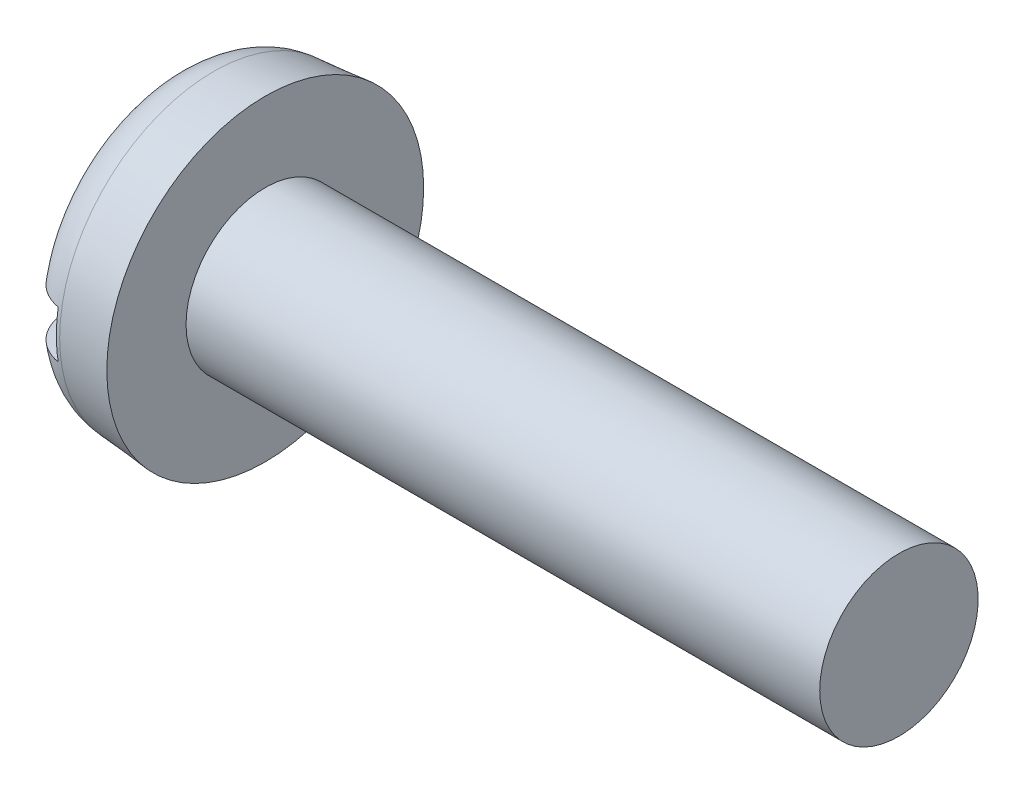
ISO-10303-21;
HEADER;
FILE_DESCRIPTION(('STEP AP214'),'2;1');
FILE_NAME('part.step','',(''),(''),'','','');
FILE_SCHEMA(('AUTOMOTIVE_DESIGN { 1 0 10303 214 1 1 1 1 }'));
ENDSEC;
DATA;
#1=APPLICATION_CONTEXT('core data for automotive mechanical design processes');
#2=APPLICATION_PROTOCOL_DEFINITION('international standard','automotive_design',2000,#1);
#3=PRODUCT_CONTEXT('',#1,'mechanical');
#4=PRODUCT('Part','Part','',(#3));
#5=PRODUCT_RELATED_PRODUCT_CATEGORY('part','',(#4));
#6=PRODUCT_DEFINITION_FORMATION('','',#4);
#7=PRODUCT_DEFINITION_CONTEXT('part definition',#1,'design');
#8=PRODUCT_DEFINITION('design','',#6,#7);
#9=PRODUCT_DEFINITION_SHAPE('','',#8);
#10=(LENGTH_UNIT() NAMED_UNIT(*) SI_UNIT(.MILLI.,.METRE.));
#11=(NAMED_UNIT(*) PLANE_ANGLE_UNIT() SI_UNIT($,.RADIAN.));
#12=(NAMED_UNIT(*) SI_UNIT($,.STERADIAN.) SOLID_ANGLE_UNIT());
#13=UNCERTAINTY_MEASURE_WITH_UNIT(LENGTH_MEASURE(1.E-05),#10,'distance_accuracy_value','');
#14=(GEOMETRIC_REPRESENTATION_CONTEXT(3) GLOBAL_UNCERTAINTY_ASSIGNED_CONTEXT((#13)) GLOBAL_UNIT_ASSIGNED_CONTEXT((#10,
#11,#12)) REPRESENTATION_CONTEXT('',''));
#15=CARTESIAN_POINT('',(0.,0.,0.));
#16=DIRECTION('',(0.,0.,1.));
#17=DIRECTION('',(1.,0.,0.));
#18=AXIS2_PLACEMENT_3D('',#15,#16,#17);
#19=CARTESIAN_POINT('',(0.,0.,0.));
#20=DIRECTION('',(-1.,0.,0.));
#21=DIRECTION('',(0.,0.,1.));
#22=AXIS2_PLACEMENT_3D('',#19,#20,#21);
#23=PLANE('',#22);
#24=DIRECTION('',(0.,0.,-1.));
#25=VECTOR('',#24,1.);
#26=CARTESIAN_POINT('',(0.,0.599999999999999,4.));
#27=LINE('',#26,#25);
#28=CARTESIAN_POINT('',(0.,0.599999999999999,2.62267277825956));
#29=VERTEX_POINT('',#28);
#30=CARTESIAN_POINT('',(0.,0.599999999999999,-2.62267277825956));
#31=VERTEX_POINT('',#30);
#32=EDGE_CURVE('E89',#29,#31,#27,.T.);
#33=ORIENTED_EDGE('',*,*,#32,.F.);
#34=CARTESIAN_POINT('',(0.,0.,0.));
#35=DIRECTION('',(-1.,0.,0.));
#36=DIRECTION('',(0.,0.,1.));
#37=AXIS2_PLACEMENT_3D('',#34,#35,#36);
#38=CIRCLE('',#37,2.69042979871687);
#39=EDGE_CURVE('E95',#29,#31,#38,.T.);
#40=ORIENTED_EDGE('',*,*,#39,.T.);
#41=EDGE_LOOP('',(#33,#40));
#42=FACE_BOUND('',#41,.T.);
#43=ADVANCED_FACE('F36',(#42),#23,.T.);
#44=CARTESIAN_POINT('',(-25.4,0.,0.));
#45=DIRECTION('',(-1.,0.,0.));
#46=DIRECTION('',(0.,0.,1.));
#47=AXIS2_PLACEMENT_3D('',#44,#45,#46);
#48=CYLINDRICAL_SURFACE('',#47,2.);
#49=CARTESIAN_POINT('',(18.4,0.,0.));
#50=DIRECTION('',(-1.,0.,0.));
#51=DIRECTION('',(0.,0.,1.));
#52=AXIS2_PLACEMENT_3D('',#49,#50,#51);
#53=CIRCLE('',#52,2.);
#54=CARTESIAN_POINT('',(18.4,0.,2.));
#55=VERTEX_POINT('',#54);
#56=EDGE_CURVE('E96',#55,#55,#53,.T.);
#57=ORIENTED_EDGE('',*,*,#56,.T.);
#58=EDGE_LOOP('',(#57));
#59=FACE_BOUND('',#58,.T.);
#60=CARTESIAN_POINT('',(2.4,0.,0.));
#61=DIRECTION('',(-1.,0.,0.));
#62=DIRECTION('',(0.,0.,1.));
#63=AXIS2_PLACEMENT_3D('',#60,#61,#62);
#64=CIRCLE('',#63,2.);
#65=CARTESIAN_POINT('',(2.4,0.,2.));
#66=VERTEX_POINT('',#65);
#67=EDGE_CURVE('E153',#66,#66,#64,.T.);
#68=ORIENTED_EDGE('',*,*,#67,.F.);
#69=EDGE_LOOP('',(#68));
#70=FACE_BOUND('',#69,.T.);
#71=ADVANCED_FACE('F141',(#59,#70),#48,.T.);
#72=CARTESIAN_POINT('',(18.4,2.,0.));
#73=DIRECTION('',(1.,0.,0.));
#74=DIRECTION('',(0.,0.,-1.));
#75=AXIS2_PLACEMENT_3D('',#72,#73,#74);
#76=PLANE('',#75);
#77=ORIENTED_EDGE('',*,*,#56,.F.);
#78=EDGE_LOOP('',(#77));
#79=FACE_BOUND('',#78,.T.);
#80=ADVANCED_FACE('F139',(#79),#76,.T.);
#81=DIRECTION('',(0.,0.,1.));
#82=VECTOR('',#81,1.);
#83=CARTESIAN_POINT('',(0.,-0.599999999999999,-4.));
#84=LINE('',#83,#82);
#85=CARTESIAN_POINT('',(0.,-0.6,-2.62267277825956));
#86=VERTEX_POINT('',#85);
#87=CARTESIAN_POINT('',(0.,-0.6,2.62267277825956));
#88=VERTEX_POINT('',#87);
#89=EDGE_CURVE('E80',#86,#88,#84,.T.);
#90=ORIENTED_EDGE('',*,*,#89,.F.);
#91=EDGE_CURVE('E87',#86,#88,#38,.T.);
#92=ORIENTED_EDGE('',*,*,#91,.T.);
#93=EDGE_LOOP('',(#90,#92));
#94=FACE_BOUND('',#93,.T.);
#95=ADVANCED_FACE('F86',(#94),#23,.T.);
#96=CARTESIAN_POINT('',(0.,0.,0.));
#97=DIRECTION('',(1.,0.,0.));
#98=DIRECTION('',(0.,0.,-1.));
#99=AXIS2_PLACEMENT_3D('',#96,#97,#98);
#100=CONICAL_SURFACE('',#99,3.79002720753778,0.0872664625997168);
#101=CARTESIAN_POINT('',(1.09541310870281,0.,0.));
#102=DIRECTION('',(-1.,0.,0.));
#103=DIRECTION('',(0.,0.,1.));
#104=AXIS2_PLACEMENT_3D('',#101,#102,#103);
#105=CIRCLE('',#104,3.88586343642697);
#106=CARTESIAN_POINT('',(1.09541310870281,0.,3.88586343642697));
#107=VERTEX_POINT('',#106);
#108=EDGE_CURVE('E99',#107,#107,#105,.F.);
#109=ORIENTED_EDGE('',*,*,#108,.T.);
#110=EDGE_LOOP('',(#109));
#111=FACE_BOUND('',#110,.T.);
#112=CARTESIAN_POINT('',(2.4,0.,0.));
#113=DIRECTION('',(-1.,0.,0.));
#114=DIRECTION('',(0.,0.,1.));
#115=AXIS2_PLACEMENT_3D('',#112,#113,#114);
#116=CIRCLE('',#115,4.);
#117=CARTESIAN_POINT('',(2.4,0.,4.));
#118=VERTEX_POINT('',#117);
#119=EDGE_CURVE('E101',#118,#118,#116,.T.);
#120=ORIENTED_EDGE('',*,*,#119,.T.);
#121=EDGE_LOOP('',(#120));
#122=FACE_BOUND('',#121,.T.);
#123=ADVANCED_FACE('F132',(#111,#122),#100,.T.);
#124=CARTESIAN_POINT('',(2.4,2.,0.));
#125=DIRECTION('',(-1.,0.,0.));
#126=DIRECTION('',(0.,0.,1.));
#127=AXIS2_PLACEMENT_3D('',#124,#125,#126);
#128=PLANE('',#127);
#129=ORIENTED_EDGE('',*,*,#119,.F.);
#130=EDGE_LOOP('',(#129));
#131=FACE_BOUND('',#130,.T.);
#132=ORIENTED_EDGE('',*,*,#67,.T.);
#133=EDGE_LOOP('',(#132));
#134=FACE_BOUND('',#133,.T.);
#135=ADVANCED_FACE('F128',(#131,#134),#128,.F.);
#136=CARTESIAN_POINT('',(1.2,0.,0.));
#137=DIRECTION('',(-1.,0.,0.));
#138=DIRECTION('',(0.,0.,1.));
#139=AXIS2_PLACEMENT_3D('',#136,#137,#138);
#140=TOROIDAL_SURFACE('',#139,2.69042979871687,1.2);
#141=CARTESIAN_POINT('',(0.3865043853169,0.599999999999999,-3.52185650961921));
#142=CARTESIAN_POINT('',(0.435468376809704,0.599999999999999,-3.56765543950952));
#143=CARTESIAN_POINT('',(0.48830443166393,0.599999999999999,-3.60938194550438));
#144=CARTESIAN_POINT('',(0.600265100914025,0.599999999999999,-3.68342203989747));
#145=CARTESIAN_POINT('',(0.659396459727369,0.599999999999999,-3.71572539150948));
#146=CARTESIAN_POINT('',(0.782252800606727,0.599999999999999,-3.76991557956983));
#147=CARTESIAN_POINT('',(0.845977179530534,0.599999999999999,-3.79180378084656));
#148=CARTESIAN_POINT('',(0.976191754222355,0.599999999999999,-3.82450279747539));
#149=CARTESIAN_POINT('',(1.04268130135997,0.599999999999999,-3.83531619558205));
#150=CARTESIAN_POINT('',(1.1761990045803,0.599999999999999,-3.84552483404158));
#151=CARTESIAN_POINT('',(1.2432228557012,0.599999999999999,-3.84497642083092));
#152=CARTESIAN_POINT('',(1.37622462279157,0.599999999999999,-3.83261582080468));
#153=CARTESIAN_POINT('',(1.44220252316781,0.599999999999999,-3.82080346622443));
#154=CARTESIAN_POINT('',(1.57113854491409,0.599999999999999,-3.7862937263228));
#155=CARTESIAN_POINT('',(1.63410108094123,0.599999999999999,-3.76361282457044));
#156=CARTESIAN_POINT('',(1.75534617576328,0.599999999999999,-3.70804459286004));
#157=CARTESIAN_POINT('',(1.81362870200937,0.599999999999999,-3.67515719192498));
#158=CARTESIAN_POINT('',(1.92413366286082,0.599999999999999,-3.5999836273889));
#159=CARTESIAN_POINT('',(1.97632984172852,0.599999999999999,-3.55765888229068));
#160=CARTESIAN_POINT('',(2.07296076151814,0.599999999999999,-3.46492588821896));
#161=CARTESIAN_POINT('',(2.11739523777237,0.599999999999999,-3.4145173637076));
#162=CARTESIAN_POINT('',(2.19773705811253,0.599999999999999,-3.30652404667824));
#163=CARTESIAN_POINT('',(2.2335546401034,0.599999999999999,-3.24887250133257));
#164=CARTESIAN_POINT('',(2.29517588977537,0.599999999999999,-3.12844912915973));
#165=CARTESIAN_POINT('',(2.32097889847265,0.599999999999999,-3.06567696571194));
#166=CARTESIAN_POINT('',(2.36230436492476,0.599999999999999,-2.93572304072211));
#167=CARTESIAN_POINT('',(2.37765465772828,0.599999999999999,-2.86848656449));
#168=CARTESIAN_POINT('',(2.39710654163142,0.599999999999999,-2.73240889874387));
#169=CARTESIAN_POINT('',(2.40120699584,0.599999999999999,-2.66356754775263));
#170=CARTESIAN_POINT('',(2.39814758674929,0.599999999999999,-2.52464946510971));
#171=CARTESIAN_POINT('',(2.39074269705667,0.599999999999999,-2.45457815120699));
#172=CARTESIAN_POINT('',(2.36454808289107,0.599999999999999,-2.31659764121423));
#173=CARTESIAN_POINT('',(2.34575688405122,0.599999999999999,-2.24868872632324));
#174=CARTESIAN_POINT('',(2.29682890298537,0.599999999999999,-2.11531585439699));
#175=CARTESIAN_POINT('',(2.26644200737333,0.599999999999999,-2.04994358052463));
#176=CARTESIAN_POINT('',(2.19524076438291,0.599999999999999,-1.92513363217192));
#177=CARTESIAN_POINT('',(2.15442449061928,0.599999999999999,-1.86569705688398));
#178=CARTESIAN_POINT('',(2.06294283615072,0.599999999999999,-1.75389115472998));
#179=CARTESIAN_POINT('',(2.01217853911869,0.599999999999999,-1.70160258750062));
#180=CARTESIAN_POINT('',(1.90235992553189,0.599999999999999,-1.60657192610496));
#181=CARTESIAN_POINT('',(1.84330597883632,0.599999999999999,-1.56382940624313));
#182=CARTESIAN_POINT('',(1.72028944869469,0.599999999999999,-1.49071034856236));
#183=CARTESIAN_POINT('',(1.65652070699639,0.599999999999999,-1.46000898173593));
#184=CARTESIAN_POINT('',(1.52445964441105,0.599999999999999,-1.41076217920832));
#185=CARTESIAN_POINT('',(1.45617085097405,0.599999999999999,-1.39220738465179));
#186=CARTESIAN_POINT('',(1.32258878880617,0.599999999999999,-1.3692588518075));
#187=CARTESIAN_POINT('',(1.25746124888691,0.599999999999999,-1.36389765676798));
#188=CARTESIAN_POINT('',(1.12729576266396,0.599999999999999,-1.36480396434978));
#189=CARTESIAN_POINT('',(1.06225779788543,0.599999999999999,-1.37106853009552));
#190=CARTESIAN_POINT('',(0.937361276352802,0.599999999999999,-1.39427975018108));
#191=CARTESIAN_POINT('',(0.877403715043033,0.599999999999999,-1.41070181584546));
#192=CARTESIAN_POINT('',(0.760914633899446,0.599999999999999,-1.45296891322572));
#193=CARTESIAN_POINT('',(0.704383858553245,0.599999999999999,-1.47881598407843));
#194=CARTESIAN_POINT('',(0.59370506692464,0.599999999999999,-1.54020998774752));
#195=CARTESIAN_POINT('',(0.539760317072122,0.599999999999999,-1.57612236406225));
#196=CARTESIAN_POINT('',(0.438104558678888,0.599999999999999,-1.65588570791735));
#197=CARTESIAN_POINT('',(0.390395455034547,0.599999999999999,-1.69973909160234));
#198=CARTESIAN_POINT('',(0.298820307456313,0.599999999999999,-1.79776253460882));
#199=CARTESIAN_POINT('',(0.255521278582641,0.599999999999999,-1.85246315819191));
#200=CARTESIAN_POINT('',(0.178283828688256,0.599999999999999,-1.96812037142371));
#201=CARTESIAN_POINT('',(0.144347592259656,0.599999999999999,-2.02907841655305));
#202=CARTESIAN_POINT('',(0.0855336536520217,0.599999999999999,-2.15824220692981));
#203=CARTESIAN_POINT('',(0.0610804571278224,0.599999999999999,-2.22664188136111));
#204=CARTESIAN_POINT('',(0.0240295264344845,0.599999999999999,-2.36658228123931));
#205=CARTESIAN_POINT('',(0.0114315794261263,0.599999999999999,-2.43812295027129));
#206=CARTESIAN_POINT('',(-0.00140349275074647,0.599999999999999,-2.58214276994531));
#207=CARTESIAN_POINT('',(-0.00166960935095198,0.599999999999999,-2.65461931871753));
#208=CARTESIAN_POINT('',(0.0102529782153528,0.599999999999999,-2.79856484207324));
#209=CARTESIAN_POINT('',(0.0224436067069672,0.599999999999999,-2.87003365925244));
#210=CARTESIAN_POINT('',(0.0586721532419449,0.599999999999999,-3.00828260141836));
#211=CARTESIAN_POINT('',(0.082454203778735,0.599999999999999,-3.07512990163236));
#212=CARTESIAN_POINT('',(0.141152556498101,0.599999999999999,-3.20367573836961));
#213=CARTESIAN_POINT('',(0.176053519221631,0.599999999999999,-3.26538122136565));
#214=CARTESIAN_POINT('',(0.240740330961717,0.599999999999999,-3.35956174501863));
#215=CARTESIAN_POINT('',(0.267410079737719,0.599999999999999,-3.39421743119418));
#216=CARTESIAN_POINT('',(0.324340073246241,0.599999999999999,-3.46044388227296));
#217=CARTESIAN_POINT('',(0.354600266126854,0.599999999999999,-3.49201469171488));
#218=CARTESIAN_POINT('',(0.3865043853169,0.599999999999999,-3.52185650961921));
#219=B_SPLINE_CURVE_WITH_KNOTS('',3,(#141,#142,#143,#144,#145,#146,#147,#148,#149,#150,#151,
#152,#153,#154,#155,#156,#157,#158,#159,#160,#161,#162,#163,#164,#165,#166,#167,#168,#169,#170,
#171,#172,#173,#174,#175,#176,#177,#178,#179,#180,#181,#182,#183,#184,#185,#186,#187,#188,#189,
#190,#191,#192,#193,#194,#195,#196,#197,#198,#199,#200,#201,#202,#203,#204,#205,#206,#207,#208,
#209,#210,#211,#212,#213,#214,#215,#216,#217,#218),.UNSPECIFIED.,.T.,.F.,(4,2,2,2,2,2,2,2,2,2,2,
2,2,2,2,2,2,2,2,2,2,2,2,2,2,2,2,2,2,2,2,2,2,2,2,2,2,2,4),(0.,0.200976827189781,
0.402171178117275,0.603339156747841,0.804460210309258,1.0045840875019,1.2047109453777,
1.40453524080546,1.60436092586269,1.80501901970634,2.00568395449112,2.2083565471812,
2.41104247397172,2.61699090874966,2.82296015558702,3.03337636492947,3.24381982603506,
3.45908552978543,3.67439102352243,3.8919572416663,4.10951375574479,4.32071351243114,
4.53175034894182,4.72677835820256,4.92175710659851,5.10742155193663,5.29312619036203,
5.48672044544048,5.68037370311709,5.88873369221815,6.09714225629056,6.31402614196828,
6.53090613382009,6.74727622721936,6.96367975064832,7.17550906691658,7.38704740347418,
7.51800243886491,7.64895558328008),.UNSPECIFIED.);
#220=CARTESIAN_POINT('',(1.,0.599999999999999,-3.8268957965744));
#221=VERTEX_POINT('',#220);
#222=EDGE_CURVE('E11',#31,#221,#219,.T.);
#223=ORIENTED_EDGE('',*,*,#222,.F.);
#224=ORIENTED_EDGE('',*,*,#39,.F.);
#225=CARTESIAN_POINT('',(0.568676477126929,0.599999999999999,1.55841219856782));
#226=CARTESIAN_POINT('',(0.622454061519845,0.599999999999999,1.52276443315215));
#227=CARTESIAN_POINT('',(0.679085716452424,0.599999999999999,1.49137245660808));
#228=CARTESIAN_POINT('',(0.796770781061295,0.599999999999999,1.43831139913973));
#229=CARTESIAN_POINT('',(0.857825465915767,0.599999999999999,1.41664513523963));
#230=CARTESIAN_POINT('',(0.982921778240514,0.599999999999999,1.38402811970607));
#231=CARTESIAN_POINT('',(1.04697051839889,0.599999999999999,1.37310440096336));
#232=CARTESIAN_POINT('',(1.17597937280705,0.599999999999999,1.36268675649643));
#233=CARTESIAN_POINT('',(1.24093916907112,0.599999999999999,1.36318893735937));
#234=CARTESIAN_POINT('',(1.36722529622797,0.599999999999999,1.37533615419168));
#235=CARTESIAN_POINT('',(1.42859438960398,0.599999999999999,1.38654477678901));
#236=CARTESIAN_POINT('',(1.54865022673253,0.599999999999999,1.41889802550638));
#237=CARTESIAN_POINT('',(1.60733638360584,0.599999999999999,1.44004481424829));
#238=CARTESIAN_POINT('',(1.72180457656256,0.599999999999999,1.49189888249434));
#239=CARTESIAN_POINT('',(1.77749881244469,0.599999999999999,1.52279911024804));
#240=CARTESIAN_POINT('',(1.88340638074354,0.599999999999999,1.59287167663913));
#241=CARTESIAN_POINT('',(1.93361816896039,0.599999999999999,1.63204633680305));
#242=CARTESIAN_POINT('',(2.03113053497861,0.599999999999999,1.7207614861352));
#243=CARTESIAN_POINT('',(2.07792119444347,0.599999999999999,1.77086293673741));
#244=CARTESIAN_POINT('',(2.16295007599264,0.599999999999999,1.87786529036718));
#245=CARTESIAN_POINT('',(2.20118595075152,0.599999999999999,1.93476805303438));
#246=CARTESIAN_POINT('',(2.26997158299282,0.599999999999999,2.05705672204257));
#247=CARTESIAN_POINT('',(2.30000838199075,0.599999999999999,2.12273201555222));
#248=CARTESIAN_POINT('',(2.34872218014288,0.599999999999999,2.25817360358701));
#249=CARTESIAN_POINT('',(2.36739836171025,0.599999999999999,2.32794019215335));
#250=CARTESIAN_POINT('',(2.39284815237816,0.599999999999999,2.47012141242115));
#251=CARTESIAN_POINT('',(2.3995382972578,0.599999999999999,2.54255105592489));
#252=CARTESIAN_POINT('',(2.40041533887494,0.599999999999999,2.68749005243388));
#253=CARTESIAN_POINT('',(2.39460324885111,0.599999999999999,2.75999939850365));
#254=CARTESIAN_POINT('',(2.37072428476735,0.599999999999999,2.90156578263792));
#255=CARTESIAN_POINT('',(2.35289092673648,0.599999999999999,2.97066215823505));
#256=CARTESIAN_POINT('',(2.3055955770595,0.599999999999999,3.10475609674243));
#257=CARTESIAN_POINT('',(2.2761350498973,0.599999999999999,3.16975417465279));
#258=CARTESIAN_POINT('',(2.20718370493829,0.599999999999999,3.29217559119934));
#259=CARTESIAN_POINT('',(2.16794580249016,0.599999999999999,3.34974141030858));
#260=CARTESIAN_POINT('',(2.08018656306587,0.599999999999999,3.45730019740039));
#261=CARTESIAN_POINT('',(2.03166624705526,0.599999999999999,3.50729399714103));
#262=CARTESIAN_POINT('',(1.92773605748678,0.599999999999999,3.59728886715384));
#263=CARTESIAN_POINT('',(1.87247613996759,0.599999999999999,3.63746317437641));
#264=CARTESIAN_POINT('',(1.75592540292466,0.599999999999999,3.70782235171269));
#265=CARTESIAN_POINT('',(1.69463504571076,0.599999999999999,3.73800798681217));
#266=CARTESIAN_POINT('',(1.5686108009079,0.599999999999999,3.78714975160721));
#267=CARTESIAN_POINT('',(1.50393088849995,0.599999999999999,3.80624437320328));
#268=CARTESIAN_POINT('',(1.37227430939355,0.599999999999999,3.83322369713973));
#269=CARTESIAN_POINT('',(1.30529774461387,0.599999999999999,3.84110889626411));
#270=CARTESIAN_POINT('',(1.17141837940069,0.599999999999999,3.845417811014));
#271=CARTESIAN_POINT('',(1.10451797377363,0.599999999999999,3.841916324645));
#272=CARTESIAN_POINT('',(0.972258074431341,0.599999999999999,3.82372114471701));
#273=CARTESIAN_POINT('',(0.906898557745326,0.599999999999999,3.80902761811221));
#274=CARTESIAN_POINT('',(0.779620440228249,0.599999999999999,3.76890152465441));
#275=CARTESIAN_POINT('',(0.717699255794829,0.599999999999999,3.74347714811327));
#276=CARTESIAN_POINT('',(0.598976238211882,0.599999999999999,3.68264222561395));
#277=CARTESIAN_POINT('',(0.542174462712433,0.599999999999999,3.64723156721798));
#278=CARTESIAN_POINT('',(0.434989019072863,0.599999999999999,3.56726339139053));
#279=CARTESIAN_POINT('',(0.384638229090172,0.599999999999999,3.5226618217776));
#280=CARTESIAN_POINT('',(0.292043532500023,0.599999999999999,3.42571932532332));
#281=CARTESIAN_POINT('',(0.249799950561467,0.599999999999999,3.37337808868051));
#282=CARTESIAN_POINT('',(0.174110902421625,0.599999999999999,3.26185326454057));
#283=CARTESIAN_POINT('',(0.140765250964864,0.599999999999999,3.20260196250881));
#284=CARTESIAN_POINT('',(0.0843091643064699,0.599999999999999,3.07941230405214));
#285=CARTESIAN_POINT('',(0.0611994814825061,0.599999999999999,3.01547360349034));
#286=CARTESIAN_POINT('',(0.0254327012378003,0.599999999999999,2.88357716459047));
#287=CARTESIAN_POINT('',(0.0129588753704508,0.599999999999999,2.81556976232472));
#288=CARTESIAN_POINT('',(-0.000658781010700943,0.599999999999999,2.67843562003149));
#289=CARTESIAN_POINT('',(-0.00180186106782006,0.599999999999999,2.60930880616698));
#290=CARTESIAN_POINT('',(0.00723867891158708,0.599999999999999,2.47027110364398));
#291=CARTESIAN_POINT('',(0.0176724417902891,0.599999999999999,2.40037650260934));
#292=CARTESIAN_POINT('',(0.0498636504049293,0.599999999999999,2.2632278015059));
#293=CARTESIAN_POINT('',(0.0716251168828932,0.599999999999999,2.19597464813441));
#294=CARTESIAN_POINT('',(0.126425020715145,0.599999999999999,2.06442921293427));
#295=CARTESIAN_POINT('',(0.159709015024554,0.599999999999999,2.00023925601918));
#296=CARTESIAN_POINT('',(0.236484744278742,0.599999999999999,1.87833288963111));
#297=CARTESIAN_POINT('',(0.279968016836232,0.599999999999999,1.82061117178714));
#298=CARTESIAN_POINT('',(0.363480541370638,0.599999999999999,1.7273106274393));
#299=CARTESIAN_POINT('',(0.401461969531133,0.599999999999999,1.68987927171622));
#300=CARTESIAN_POINT('',(0.481873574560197,0.599999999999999,1.62013708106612));
#301=CARTESIAN_POINT('',(0.524303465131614,0.599999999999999,1.58782591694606));
#302=CARTESIAN_POINT('',(0.568676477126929,0.599999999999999,1.55841219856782));
#303=B_SPLINE_CURVE_WITH_KNOTS('',3,(#225,#226,#227,#228,#229,#230,#231,#232,#233,#234,#235,
#236,#237,#238,#239,#240,#241,#242,#243,#244,#245,#246,#247,#248,#249,#250,#251,#252,#253,#254,
#255,#256,#257,#258,#259,#260,#261,#262,#263,#264,#265,#266,#267,#268,#269,#270,#271,#272,#273,
#274,#275,#276,#277,#278,#279,#280,#281,#282,#283,#284,#285,#286,#287,#288,#289,#290,#291,#292,
#293,#294,#295,#296,#297,#298,#299,#300,#301,#302),.UNSPECIFIED.,.T.,.F.,(4,2,2,2,2,2,2,2,2,2,2,
2,2,2,2,2,2,2,2,2,2,2,2,2,2,2,2,2,2,2,2,2,2,2,2,2,2,2,4),(0.,0.193385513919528,
0.386827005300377,0.580754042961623,0.774615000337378,0.960896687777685,1.14721893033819,
1.33748625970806,1.52780704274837,1.73256769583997,1.93738446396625,2.15302491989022,
2.3686808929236,2.58583282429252,2.80296715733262,3.01600070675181,3.22900743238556,
3.43699107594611,3.64495185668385,3.84892478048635,4.05288207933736,4.25423457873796,
4.45557815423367,4.65560180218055,4.85562246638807,5.05549074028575,5.25536126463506,
5.45621303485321,5.6570728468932,5.86009921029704,6.06314049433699,6.26961358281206,
6.47610034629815,6.68713711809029,6.89824884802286,7.11416888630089,7.3299104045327,
7.4894871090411,7.64905354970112),.UNSPECIFIED.);
#304=CARTESIAN_POINT('',(1.,0.599999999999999,3.8268957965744));
#305=VERTEX_POINT('',#304);
#306=EDGE_CURVE('E113',#305,#29,#303,.T.);
#307=ORIENTED_EDGE('',*,*,#306,.F.);
#308=CARTESIAN_POINT('',(1.,0.,0.));
#309=DIRECTION('',(-1.,0.,0.));
#310=DIRECTION('',(0.,0.,1.));
#311=AXIS2_PLACEMENT_3D('',#308,#309,#310);
#312=CIRCLE('',#311,3.8736457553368);
#313=CARTESIAN_POINT('',(1.,-0.600000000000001,3.8268957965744));
#314=VERTEX_POINT('',#313);
#315=EDGE_CURVE('E107',#305,#314,#312,.F.);
#316=ORIENTED_EDGE('',*,*,#315,.T.);
#317=CARTESIAN_POINT('',(0.568676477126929,-0.6,1.55841219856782));
#318=CARTESIAN_POINT('',(0.509332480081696,-0.6,1.59775463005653));
#319=CARTESIAN_POINT('',(0.453379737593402,-0.6,1.64234041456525));
#320=CARTESIAN_POINT('',(0.349719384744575,-0.6,1.74035526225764));
#321=CARTESIAN_POINT('',(0.302029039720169,-0.6,1.79380239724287));
#322=CARTESIAN_POINT('',(0.216237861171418,-0.6,1.90774469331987));
#323=CARTESIAN_POINT('',(0.178118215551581,-0.6,1.96822568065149));
#324=CARTESIAN_POINT('',(0.112363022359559,-0.6,2.0946004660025));
#325=CARTESIAN_POINT('',(0.0847225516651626,-0.6,2.16049170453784));
#326=CARTESIAN_POINT('',(0.0402688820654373,-0.6,2.29725613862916));
#327=CARTESIAN_POINT('',(0.0236758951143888,-0.6,2.36820113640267));
#328=CARTESIAN_POINT('',(0.00278349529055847,-0.6,2.51189141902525));
#329=CARTESIAN_POINT('',(-0.00151505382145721,-0.6,2.58463683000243));
#330=CARTESIAN_POINT('',(0.00243750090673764,-0.6,2.72894600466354));
#331=CARTESIAN_POINT('',(0.010543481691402,-0.6,2.80051368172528));
#332=CARTESIAN_POINT('',(0.0389520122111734,-0.6,2.94118836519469));
#333=CARTESIAN_POINT('',(0.0592529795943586,-0.6,3.01029568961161));
#334=CARTESIAN_POINT('',(0.110960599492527,-0.6,3.1423581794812));
#335=CARTESIAN_POINT('',(0.142096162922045,-0.6,3.20541948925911));
#336=CARTESIAN_POINT('',(0.214736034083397,-0.6,3.32525905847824));
#337=CARTESIAN_POINT('',(0.256239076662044,-0.6,3.38203808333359));
#338=CARTESIAN_POINT('',(0.347460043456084,-0.6,3.48641848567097));
#339=CARTESIAN_POINT('',(0.396982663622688,-0.6,3.53419059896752));
#340=CARTESIAN_POINT('',(0.503454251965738,-0.6,3.62058393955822));
#341=CARTESIAN_POINT('',(0.560402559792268,-0.600000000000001,3.6592059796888));
#342=CARTESIAN_POINT('',(0.67915616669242,-0.600000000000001,3.72559524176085));
#343=CARTESIAN_POINT('',(0.740873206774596,-0.600000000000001,3.75352040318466));
#344=CARTESIAN_POINT('',(0.868147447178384,-0.600000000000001,3.79850563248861));
#345=CARTESIAN_POINT('',(0.933704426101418,-0.600000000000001,3.81556632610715));
#346=CARTESIAN_POINT('',(1.06616217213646,-0.600000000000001,3.83820251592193));
#347=CARTESIAN_POINT('',(1.13304550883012,-0.600000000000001,3.84388011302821));
#348=CARTESIAN_POINT('',(1.26681198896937,-0.600000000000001,3.84388783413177));
#349=CARTESIAN_POINT('',(1.33369513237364,-0.600000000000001,3.83821825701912));
#350=CARTESIAN_POINT('',(1.46534857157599,-0.600000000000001,3.81573676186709));
#351=CARTESIAN_POINT('',(1.5301247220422,-0.600000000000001,3.79895909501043));
#352=CARTESIAN_POINT('',(1.65595122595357,-0.600000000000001,3.75479405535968));
#353=CARTESIAN_POINT('',(1.7170015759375,-0.600000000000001,3.72740667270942));
#354=CARTESIAN_POINT('',(1.83382644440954,-0.600000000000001,3.66274505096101));
#355=CARTESIAN_POINT('',(1.88958679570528,-0.6,3.62544522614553));
#356=CARTESIAN_POINT('',(1.99411858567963,-0.6,3.54208564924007));
#357=CARTESIAN_POINT('',(2.04288982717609,-0.6,3.49602565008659));
#358=CARTESIAN_POINT('',(2.1325144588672,-0.6,3.39605796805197));
#359=CARTESIAN_POINT('',(2.17329813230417,-0.6,3.34208780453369));
#360=CARTESIAN_POINT('',(2.245373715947,-0.6,3.22814724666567));
#361=CARTESIAN_POINT('',(2.27666509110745,-0.6,3.16817651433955));
#362=CARTESIAN_POINT('',(2.32937247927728,-0.6,3.04302336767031));
#363=CARTESIAN_POINT('',(2.35063955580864,-0.6,2.97777826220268));
#364=CARTESIAN_POINT('',(2.3821555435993,-0.6,2.84468257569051));
#365=CARTESIAN_POINT('',(2.39240345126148,-0.6,2.77683175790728));
#366=CARTESIAN_POINT('',(2.40182781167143,-0.6,2.6389851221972));
#367=CARTESIAN_POINT('',(2.40077563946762,-0.6,2.56897370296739));
#368=CARTESIAN_POINT('',(2.38721389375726,-0.6,2.43007140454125));
#369=CARTESIAN_POINT('',(2.37470291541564,-0.6,2.36118066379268));
#370=CARTESIAN_POINT('',(2.33824897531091,-0.6,2.22476443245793));
#371=CARTESIAN_POINT('',(2.31404566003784,-0.6,2.15730848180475));
#372=CARTESIAN_POINT('',(2.25484108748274,-0.6,2.02730649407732));
#373=CARTESIAN_POINT('',(2.21983804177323,-0.6,1.96476127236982));
#374=CARTESIAN_POINT('',(2.13932874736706,-0.6,1.8453529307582));
#375=CARTESIAN_POINT('',(2.09366234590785,-0.6,1.78859760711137));
#376=CARTESIAN_POINT('',(1.99331431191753,-0.6,1.68367587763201));
#377=CARTESIAN_POINT('',(1.93863170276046,-0.6,1.63551040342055));
#378=CARTESIAN_POINT('',(1.82254625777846,-0.6,1.55016942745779));
#379=CARTESIAN_POINT('',(1.7612597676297,-0.6,1.51283623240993));
#380=CARTESIAN_POINT('',(1.6329601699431,-0.6,1.44984263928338));
#381=CARTESIAN_POINT('',(1.56595104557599,-0.6,1.42417419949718));
#382=CARTESIAN_POINT('',(1.43290073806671,-0.6,1.38720166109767));
#383=CARTESIAN_POINT('',(1.36709528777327,-0.6,1.37505067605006));
#384=CARTESIAN_POINT('',(1.23436273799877,-0.6,1.3628486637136));
#385=CARTESIAN_POINT('',(1.16743586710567,-0.6,1.36279519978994));
#386=CARTESIAN_POINT('',(1.03904581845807,-0.6,1.37438428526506));
#387=CARTESIAN_POINT('',(0.97751125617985,-0.6,1.38526326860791));
#388=CARTESIAN_POINT('',(0.857136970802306,-0.6,1.41700902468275));
#389=CARTESIAN_POINT('',(0.79829431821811,-0.6,1.43786464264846));
#390=CARTESIAN_POINT('',(0.711456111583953,-0.6,1.47666141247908));
#391=CARTESIAN_POINT('',(0.681965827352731,-0.6,1.49136190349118));
#392=CARTESIAN_POINT('',(0.624300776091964,-0.6,1.52313858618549));
#393=CARTESIAN_POINT('',(0.596125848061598,-0.6,1.54021448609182));
#394=CARTESIAN_POINT('',(0.568676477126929,-0.6,1.55841219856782));
#395=B_SPLINE_CURVE_WITH_KNOTS('',3,(#317,#318,#319,#320,#321,#322,#323,#324,#325,#326,#327,
#328,#329,#330,#331,#332,#333,#334,#335,#336,#337,#338,#339,#340,#341,#342,#343,#344,#345,#346,
#347,#348,#349,#350,#351,#352,#353,#354,#355,#356,#357,#358,#359,#360,#361,#362,#363,#364,#365,
#366,#367,#368,#369,#370,#371,#372,#373,#374,#375,#376,#377,#378,#379,#380,#381,#382,#383,#384,
#385,#386,#387,#388,#389,#390,#391,#392,#393,#394),.UNSPECIFIED.,.T.,.F.,(4,2,2,2,2,2,2,2,2,2,2,
2,2,2,2,2,2,2,2,2,2,2,2,2,2,2,2,2,2,2,2,2,2,2,2,2,2,2,4),(0.,0.2134759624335,0.427392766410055,
0.640885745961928,0.854278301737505,1.07180637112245,1.28934972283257,1.50436737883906,
1.71935714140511,1.92931435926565,2.13924596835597,2.34467456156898,2.55008489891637,
2.75233330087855,2.95457005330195,3.15498457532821,3.355393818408,3.55518797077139,
3.75498230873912,3.95529744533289,4.15561823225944,4.35761633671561,4.55962582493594,
4.76454879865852,4.96949043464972,5.17858616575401,5.38770753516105,5.60171647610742,
5.815760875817,6.03325422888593,6.25077115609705,6.46494128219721,6.67896353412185,
6.87865214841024,7.07830054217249,7.26491113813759,7.4513135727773,7.55006829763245,
7.64881090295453),.UNSPECIFIED.);
#396=EDGE_CURVE('E94',#88,#314,#395,.T.);
#397=ORIENTED_EDGE('',*,*,#396,.F.);
#398=ORIENTED_EDGE('',*,*,#91,.F.);
#399=CARTESIAN_POINT('',(0.3865043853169,-0.6,-3.52185650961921));
#400=CARTESIAN_POINT('',(0.336558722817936,-0.6,-3.47513075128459));
#401=CARTESIAN_POINT('',(0.290567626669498,-0.6,-3.42409544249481));
#402=CARTESIAN_POINT('',(0.207816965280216,-0.6,-3.31495007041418));
#403=CARTESIAN_POINT('',(0.171070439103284,-0.6,-3.2568301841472));
#404=CARTESIAN_POINT('',(0.107859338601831,-0.6,-3.13533662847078));
#405=CARTESIAN_POINT('',(0.081381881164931,-0.6,-3.07196966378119));
#406=CARTESIAN_POINT('',(0.0392838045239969,-0.6,-2.94175448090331));
#407=CARTESIAN_POINT('',(0.0236604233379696,-0.6,-2.87490715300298));
#408=CARTESIAN_POINT('',(0.00341113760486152,-0.6,-2.73858284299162));
#409=CARTESIAN_POINT('',(-0.00105268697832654,-0.6,-2.66908182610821));
#410=CARTESIAN_POINT('',(0.00147102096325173,-0.6,-2.53028718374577));
#411=CARTESIAN_POINT('',(0.00846038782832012,-0.6,-2.46099359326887));
#412=CARTESIAN_POINT('',(0.0338721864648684,-0.6,-2.3228723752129));
#413=CARTESIAN_POINT('',(0.052556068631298,-0.6,-2.25409284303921));
#414=CARTESIAN_POINT('',(0.100979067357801,-0.6,-2.12053875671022));
#415=CARTESIAN_POINT('',(0.13071979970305,-0.6,-2.05576478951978));
#416=CARTESIAN_POINT('',(0.201105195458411,-0.6,-1.93075930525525));
#417=CARTESIAN_POINT('',(0.241951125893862,-0.6,-1.87064095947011));
#418=CARTESIAN_POINT('',(0.333200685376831,-0.6,-1.75812796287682));
#419=CARTESIAN_POINT('',(0.383605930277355,-0.6,-1.70573462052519));
#420=CARTESIAN_POINT('',(0.49243046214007,-0.6,-1.61063718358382));
#421=CARTESIAN_POINT('',(0.550808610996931,-0.6,-1.5678861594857));
#422=CARTESIAN_POINT('',(0.674249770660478,-0.6,-1.49345451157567));
#423=CARTESIAN_POINT('',(0.739309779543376,-0.6,-1.46176894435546));
#424=CARTESIAN_POINT('',(0.870462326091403,-0.6,-1.41247032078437));
#425=CARTESIAN_POINT('',(0.936297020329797,-0.6,-1.39417366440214));
#426=CARTESIAN_POINT('',(1.0701878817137,-0.6,-1.36992148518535));
#427=CARTESIAN_POINT('',(1.13824253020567,-0.6,-1.36395769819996));
#428=CARTESIAN_POINT('',(1.26912997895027,-0.6,-1.36469761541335));
#429=CARTESIAN_POINT('',(1.33196990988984,-0.6,-1.37048080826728));
#430=CARTESIAN_POINT('',(1.45576558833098,-0.6,-1.39257493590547));
#431=CARTESIAN_POINT('',(1.51672119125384,-0.6,-1.40888667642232));
#432=CARTESIAN_POINT('',(1.63489640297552,-0.6,-1.45115860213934));
#433=CARTESIAN_POINT('',(1.6921296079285,-0.6,-1.47708105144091));
#434=CARTESIAN_POINT('',(1.80183592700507,-0.6,-1.53754737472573));
#435=CARTESIAN_POINT('',(1.85430778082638,-0.6,-1.57209352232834));
#436=CARTESIAN_POINT('',(1.95690912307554,-0.6,-1.65139148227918));
#437=CARTESIAN_POINT('',(2.00661704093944,-0.6,-1.69668868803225));
#438=CARTESIAN_POINT('',(2.09829662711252,-0.6,-1.79453297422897));
#439=CARTESIAN_POINT('',(2.14026595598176,-0.6,-1.84708223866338));
#440=CARTESIAN_POINT('',(2.21793843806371,-0.6,-1.96160125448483));
#441=CARTESIAN_POINT('',(2.25307298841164,-0.6,-2.02395766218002));
#442=CARTESIAN_POINT('',(2.31259182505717,-0.6,-2.15361082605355));
#443=CARTESIAN_POINT('',(2.33697474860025,-0.6,-2.22090820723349));
#444=CARTESIAN_POINT('',(2.37457912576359,-0.6,-2.35984116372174));
#445=CARTESIAN_POINT('',(2.38759592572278,-0.6,-2.43153235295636));
#446=CARTESIAN_POINT('',(2.40121636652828,-0.6,-2.57608878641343));
#447=CARTESIAN_POINT('',(2.40182066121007,-0.6,-2.64895396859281));
#448=CARTESIAN_POINT('',(2.39052951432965,-0.6,-2.79263451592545));
#449=CARTESIAN_POINT('',(2.37881794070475,-0.6,-2.86346426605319));
#450=CARTESIAN_POINT('',(2.34337531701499,-0.6,-3.00205279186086));
#451=CARTESIAN_POINT('',(2.31964575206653,-0.6,-3.06981194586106));
#452=CARTESIAN_POINT('',(2.26145401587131,-0.6,-3.19862221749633));
#453=CARTESIAN_POINT('',(2.22725936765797,-0.6,-3.25979420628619));
#454=CARTESIAN_POINT('',(2.14887906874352,-0.6,-3.375364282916));
#455=CARTESIAN_POINT('',(2.10469456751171,-0.6,-3.42976314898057));
#456=CARTESIAN_POINT('',(2.00858874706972,-0.6,-3.52906182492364));
#457=CARTESIAN_POINT('',(1.95684621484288,-0.599999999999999,-3.57413473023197));
#458=CARTESIAN_POINT('',(1.84643427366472,-0.599999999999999,-3.65480066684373));
#459=CARTESIAN_POINT('',(1.78776544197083,-0.599999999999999,-3.6903944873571));
#460=CARTESIAN_POINT('',(1.66608419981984,-0.599999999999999,-3.75057174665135));
#461=CARTESIAN_POINT('',(1.60314657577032,-0.599999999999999,-3.77530647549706));
#462=CARTESIAN_POINT('',(1.47399447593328,-0.599999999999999,-3.81375981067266));
#463=CARTESIAN_POINT('',(1.40778030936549,-0.599999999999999,-3.82747945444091));
#464=CARTESIAN_POINT('',(1.27453622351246,-0.599999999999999,-3.84342379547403));
#465=CARTESIAN_POINT('',(1.20751747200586,-0.599999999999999,-3.8457419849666));
#466=CARTESIAN_POINT('',(1.07402733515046,-0.599999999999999,-3.83906549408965));
#467=CARTESIAN_POINT('',(1.00755608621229,-0.599999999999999,-3.83006807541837));
#468=CARTESIAN_POINT('',(0.877192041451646,-0.599999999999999,-3.80105552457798));
#469=CARTESIAN_POINT('',(0.813295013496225,-0.599999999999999,-3.78105934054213));
#470=CARTESIAN_POINT('',(0.68980965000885,-0.599999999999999,-3.73066689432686));
#471=CARTESIAN_POINT('',(0.630215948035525,-0.599999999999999,-3.7002838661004));
#472=CARTESIAN_POINT('',(0.540159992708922,-0.599999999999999,-3.64444320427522));
#473=CARTESIAN_POINT('',(0.507753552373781,-0.6,-3.62205529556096));
#474=CARTESIAN_POINT('',(0.445296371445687,-0.6,-3.57420610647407));
#475=CARTESIAN_POINT('',(0.415245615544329,-0.6,-3.54874484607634));
#476=CARTESIAN_POINT('',(0.3865043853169,-0.6,-3.52185650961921));
#477=B_SPLINE_CURVE_WITH_KNOTS('',3,(#399,#400,#401,#402,#403,#404,#405,#406,#407,#408,#409,
#410,#411,#412,#413,#414,#415,#416,#417,#418,#419,#420,#421,#422,#423,#424,#425,#426,#427,#428,
#429,#430,#431,#432,#433,#434,#435,#436,#437,#438,#439,#440,#441,#442,#443,#444,#445,#446,#447,
#448,#449,#450,#451,#452,#453,#454,#455,#456,#457,#458,#459,#460,#461,#462,#463,#464,#465,#466,
#467,#468,#469,#470,#471,#472,#473,#474,#475,#476),.UNSPECIFIED.,.T.,.F.,(4,2,2,2,2,2,2,2,2,2,2,
2,2,2,2,2,2,2,2,2,2,2,2,2,2,2,2,2,2,2,2,2,2,2,2,2,2,2,4),(0.,0.205037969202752,
0.410363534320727,0.615430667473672,0.82044559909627,1.02842128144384,1.23643027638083,
1.44926442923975,1.66212969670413,1.87914472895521,2.09619647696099,2.31216786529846,
2.52804264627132,2.73193279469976,2.93568627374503,3.12408907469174,3.31250629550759,
3.50019140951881,3.68792605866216,3.88881168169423,4.08975793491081,4.3034897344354,
4.51724861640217,4.73478137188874,4.95230266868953,5.16662200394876,5.38091486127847,
5.59013202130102,5.79932512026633,6.00419443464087,6.20904668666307,6.41094657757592,
6.61282745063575,6.81305010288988,7.01332121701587,7.2132483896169,7.41292177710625,
7.53091163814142,7.64890073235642),.UNSPECIFIED.);
#478=CARTESIAN_POINT('',(1.,-0.599999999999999,-3.8268957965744));
#479=VERTEX_POINT('',#478);
#480=EDGE_CURVE('E48',#479,#86,#477,.T.);
#481=ORIENTED_EDGE('',*,*,#480,.F.);
#482=EDGE_CURVE('E60',#479,#221,#312,.F.);
#483=ORIENTED_EDGE('',*,*,#482,.T.);
#484=EDGE_LOOP('',(#223,#224,#307,#316,#397,#398,#481,#483));
#485=FACE_BOUND('',#484,.T.);
#486=ORIENTED_EDGE('',*,*,#108,.F.);
#487=EDGE_LOOP('',(#486));
#488=FACE_BOUND('',#487,.T.);
#489=ADVANCED_FACE('F38',(#485,#488),#140,.T.);
#490=CARTESIAN_POINT('',(1.,0.599999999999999,4.));
#491=DIRECTION('',(0.,1.,0.));
#492=DIRECTION('',(0.,0.,1.));
#493=AXIS2_PLACEMENT_3D('',#490,#491,#492);
#494=PLANE('',#493);
#495=ORIENTED_EDGE('',*,*,#222,.T.);
#496=DIRECTION('',(0.,0.,-1.));
#497=VECTOR('',#496,1.);
#498=CARTESIAN_POINT('',(1.,0.599999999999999,4.));
#499=LINE('',#498,#497);
#500=EDGE_CURVE('E88',#305,#221,#499,.T.);
#501=ORIENTED_EDGE('',*,*,#500,.F.);
#502=ORIENTED_EDGE('',*,*,#306,.T.);
#503=ORIENTED_EDGE('',*,*,#32,.T.);
#504=EDGE_LOOP('',(#495,#501,#502,#503));
#505=FACE_BOUND('',#504,.T.);
#506=ADVANCED_FACE('F120',(#505),#494,.F.);
#507=CARTESIAN_POINT('',(1.,-0.599999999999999,-4.));
#508=DIRECTION('',(0.,-1.,0.));
#509=DIRECTION('',(0.,0.,-1.));
#510=AXIS2_PLACEMENT_3D('',#507,#508,#509);
#511=PLANE('',#510);
#512=ORIENTED_EDGE('',*,*,#480,.T.);
#513=ORIENTED_EDGE('',*,*,#89,.T.);
#514=ORIENTED_EDGE('',*,*,#396,.T.);
#515=DIRECTION('',(0.,0.,1.));
#516=VECTOR('',#515,1.);
#517=CARTESIAN_POINT('',(1.,-0.599999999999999,-4.));
#518=LINE('',#517,#516);
#519=EDGE_CURVE('E55',#479,#314,#518,.T.);
#520=ORIENTED_EDGE('',*,*,#519,.F.);
#521=EDGE_LOOP('',(#512,#513,#514,#520));
#522=FACE_BOUND('',#521,.T.);
#523=ADVANCED_FACE('F79',(#522),#511,.F.);
#524=CARTESIAN_POINT('',(1.,0.599999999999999,-4.));
#525=DIRECTION('',(-1.,0.,0.));
#526=DIRECTION('',(0.,0.,1.));
#527=AXIS2_PLACEMENT_3D('',#524,#525,#526);
#528=PLANE('',#527);
#529=ORIENTED_EDGE('',*,*,#519,.T.);
#530=ORIENTED_EDGE('',*,*,#315,.F.);
#531=ORIENTED_EDGE('',*,*,#500,.T.);
#532=ORIENTED_EDGE('',*,*,#482,.F.);
#533=EDGE_LOOP('',(#529,#530,#531,#532));
#534=FACE_BOUND('',#533,.T.);
#535=ADVANCED_FACE('F119',(#534),#528,.T.);
#536=CLOSED_SHELL('',(#43,#71,#80,#95,#123,#135,#489,#506,#523,#535));
#537=MANIFOLD_SOLID_BREP('B2',#536);
#538=ADVANCED_BREP_SHAPE_REPRESENTATION('',(#18,#537),#14);
#539=SHAPE_DEFINITION_REPRESENTATION(#9,#538);
ENDSEC;
END-ISO-10303-21;
